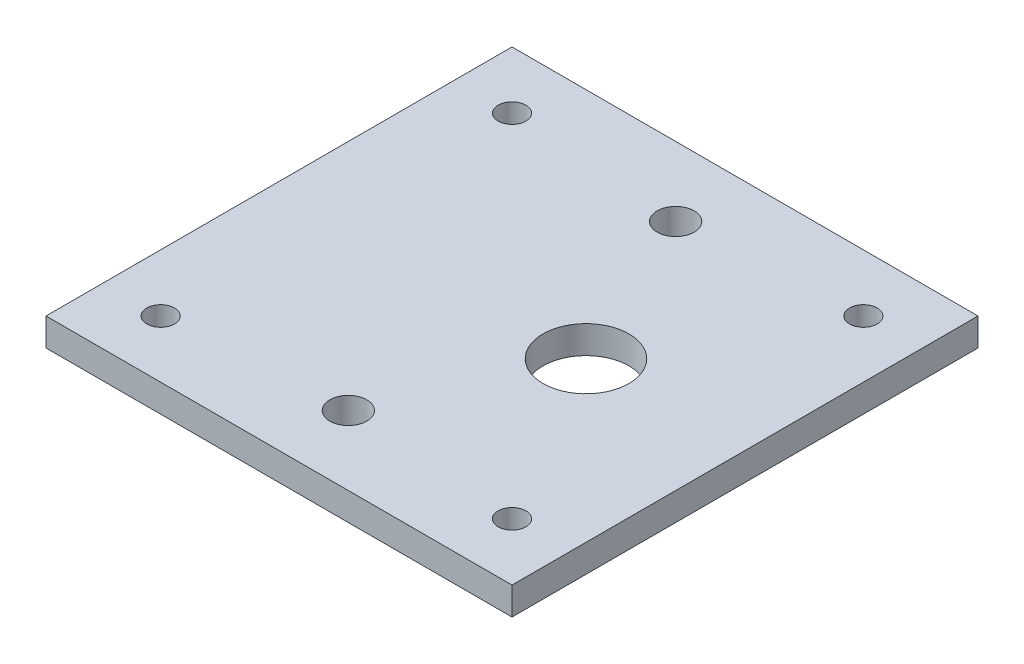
ISO-10303-21;
HEADER;
FILE_DESCRIPTION(('STEP AP214'),'2;1');
FILE_NAME('part.step','',(''),(''),'','','');
FILE_SCHEMA(('AUTOMOTIVE_DESIGN { 1 0 10303 214 1 1 1 1 }'));
ENDSEC;
DATA;
#1=APPLICATION_CONTEXT('core data for automotive mechanical design processes');
#2=APPLICATION_PROTOCOL_DEFINITION('international standard','automotive_design',2000,#1);
#3=PRODUCT_CONTEXT('',#1,'mechanical');
#4=PRODUCT('Part','Part','',(#3));
#5=PRODUCT_RELATED_PRODUCT_CATEGORY('part','',(#4));
#6=PRODUCT_DEFINITION_FORMATION('','',#4);
#7=PRODUCT_DEFINITION_CONTEXT('part definition',#1,'design');
#8=PRODUCT_DEFINITION('design','',#6,#7);
#9=PRODUCT_DEFINITION_SHAPE('','',#8);
#10=(LENGTH_UNIT() NAMED_UNIT(*) SI_UNIT(.MILLI.,.METRE.));
#11=(NAMED_UNIT(*) PLANE_ANGLE_UNIT() SI_UNIT($,.RADIAN.));
#12=(NAMED_UNIT(*) SI_UNIT($,.STERADIAN.) SOLID_ANGLE_UNIT());
#13=UNCERTAINTY_MEASURE_WITH_UNIT(LENGTH_MEASURE(1.E-05),#10,'distance_accuracy_value','');
#14=(GEOMETRIC_REPRESENTATION_CONTEXT(3) GLOBAL_UNCERTAINTY_ASSIGNED_CONTEXT((#13)) GLOBAL_UNIT_ASSIGNED_CONTEXT((#10,
#11,#12)) REPRESENTATION_CONTEXT('',''));
#15=CARTESIAN_POINT('',(0.,0.,0.));
#16=DIRECTION('',(0.,0.,1.));
#17=DIRECTION('',(1.,0.,0.));
#18=AXIS2_PLACEMENT_3D('',#15,#16,#17);
#19=CARTESIAN_POINT('',(25.2,-3.,-25.2));
#20=DIRECTION('',(1.,0.,0.));
#21=DIRECTION('',(0.,0.,-1.));
#22=AXIS2_PLACEMENT_3D('',#19,#20,#21);
#23=PLANE('',#22);
#24=DIRECTION('',(0.,0.,-1.));
#25=VECTOR('',#24,1.);
#26=CARTESIAN_POINT('',(25.2,0.,-25.2));
#27=LINE('',#26,#25);
#28=CARTESIAN_POINT('',(25.2,0.,25.2));
#29=VERTEX_POINT('',#28);
#30=CARTESIAN_POINT('',(25.2,0.,-25.2));
#31=VERTEX_POINT('',#30);
#32=EDGE_CURVE('E106',#29,#31,#27,.T.);
#33=ORIENTED_EDGE('',*,*,#32,.F.);
#34=DIRECTION('',(0.,1.,0.));
#35=VECTOR('',#34,1.);
#36=CARTESIAN_POINT('',(25.2,-3.,25.2));
#37=LINE('',#36,#35);
#38=CARTESIAN_POINT('',(25.2,-3.,25.2));
#39=VERTEX_POINT('',#38);
#40=EDGE_CURVE('E11',#39,#29,#37,.T.);
#41=ORIENTED_EDGE('',*,*,#40,.F.);
#42=DIRECTION('',(0.,0.,-1.));
#43=VECTOR('',#42,1.);
#44=CARTESIAN_POINT('',(25.2,-3.,-25.2));
#45=LINE('',#44,#43);
#46=CARTESIAN_POINT('',(25.2,-3.,-25.2));
#47=VERTEX_POINT('',#46);
#48=EDGE_CURVE('E99',#39,#47,#45,.T.);
#49=ORIENTED_EDGE('',*,*,#48,.T.);
#50=DIRECTION('',(0.,1.,0.));
#51=VECTOR('',#50,1.);
#52=CARTESIAN_POINT('',(25.2,-3.,-25.2));
#53=LINE('',#52,#51);
#54=EDGE_CURVE('E82',#47,#31,#53,.T.);
#55=ORIENTED_EDGE('',*,*,#54,.T.);
#56=EDGE_LOOP('',(#33,#41,#49,#55));
#57=FACE_BOUND('',#56,.T.);
#58=ADVANCED_FACE('F39',(#57),#23,.T.);
#59=CARTESIAN_POINT('',(-25.2,-3.,25.2));
#60=DIRECTION('',(0.,0.,1.));
#61=DIRECTION('',(1.,0.,0.));
#62=AXIS2_PLACEMENT_3D('',#59,#60,#61);
#63=PLANE('',#62);
#64=DIRECTION('',(1.,0.,0.));
#65=VECTOR('',#64,1.);
#66=CARTESIAN_POINT('',(-25.2,0.,25.2));
#67=LINE('',#66,#65);
#68=CARTESIAN_POINT('',(-25.2,0.,25.2));
#69=VERTEX_POINT('',#68);
#70=EDGE_CURVE('E101',#69,#29,#67,.T.);
#71=ORIENTED_EDGE('',*,*,#70,.F.);
#72=DIRECTION('',(0.,1.,0.));
#73=VECTOR('',#72,1.);
#74=CARTESIAN_POINT('',(-25.2,-3.,25.2));
#75=LINE('',#74,#73);
#76=CARTESIAN_POINT('',(-25.2,-3.,25.2));
#77=VERTEX_POINT('',#76);
#78=EDGE_CURVE('E48',#77,#69,#75,.T.);
#79=ORIENTED_EDGE('',*,*,#78,.F.);
#80=DIRECTION('',(1.,0.,0.));
#81=VECTOR('',#80,1.);
#82=CARTESIAN_POINT('',(-25.2,-3.,25.2));
#83=LINE('',#82,#81);
#84=EDGE_CURVE('E96',#77,#39,#83,.T.);
#85=ORIENTED_EDGE('',*,*,#84,.T.);
#86=ORIENTED_EDGE('',*,*,#40,.T.);
#87=EDGE_LOOP('',(#71,#79,#85,#86));
#88=FACE_BOUND('',#87,.T.);
#89=ADVANCED_FACE('F173',(#88),#63,.T.);
#90=CARTESIAN_POINT('',(-25.2,-3.,-25.2));
#91=DIRECTION('',(-1.,0.,0.));
#92=DIRECTION('',(0.,0.,1.));
#93=AXIS2_PLACEMENT_3D('',#90,#91,#92);
#94=PLANE('',#93);
#95=DIRECTION('',(0.,0.,1.));
#96=VECTOR('',#95,1.);
#97=CARTESIAN_POINT('',(-25.2,0.,-25.2));
#98=LINE('',#97,#96);
#99=CARTESIAN_POINT('',(-25.2,0.,-25.2));
#100=VERTEX_POINT('',#99);
#101=EDGE_CURVE('E90',#100,#69,#98,.T.);
#102=ORIENTED_EDGE('',*,*,#101,.F.);
#103=DIRECTION('',(0.,1.,0.));
#104=VECTOR('',#103,1.);
#105=CARTESIAN_POINT('',(-25.2,-3.,-25.2));
#106=LINE('',#105,#104);
#107=CARTESIAN_POINT('',(-25.2,-3.,-25.2));
#108=VERTEX_POINT('',#107);
#109=EDGE_CURVE('E85',#108,#100,#106,.T.);
#110=ORIENTED_EDGE('',*,*,#109,.F.);
#111=DIRECTION('',(0.,0.,1.));
#112=VECTOR('',#111,1.);
#113=CARTESIAN_POINT('',(-25.2,-3.,-25.2));
#114=LINE('',#113,#112);
#115=EDGE_CURVE('E88',#108,#77,#114,.T.);
#116=ORIENTED_EDGE('',*,*,#115,.T.);
#117=ORIENTED_EDGE('',*,*,#78,.T.);
#118=EDGE_LOOP('',(#102,#110,#116,#117));
#119=FACE_BOUND('',#118,.T.);
#120=ADVANCED_FACE('F87',(#119),#94,.T.);
#121=CARTESIAN_POINT('',(-25.2,-3.,-25.2));
#122=DIRECTION('',(0.,0.,-1.));
#123=DIRECTION('',(-1.,0.,0.));
#124=AXIS2_PLACEMENT_3D('',#121,#122,#123);
#125=PLANE('',#124);
#126=DIRECTION('',(-1.,0.,0.));
#127=VECTOR('',#126,1.);
#128=CARTESIAN_POINT('',(-25.2,0.,-25.2));
#129=LINE('',#128,#127);
#130=EDGE_CURVE('E109',#31,#100,#129,.T.);
#131=ORIENTED_EDGE('',*,*,#130,.F.);
#132=ORIENTED_EDGE('',*,*,#54,.F.);
#133=DIRECTION('',(-1.,0.,0.));
#134=VECTOR('',#133,1.);
#135=CARTESIAN_POINT('',(-25.2,-3.,-25.2));
#136=LINE('',#135,#134);
#137=EDGE_CURVE('E95',#47,#108,#136,.T.);
#138=ORIENTED_EDGE('',*,*,#137,.T.);
#139=ORIENTED_EDGE('',*,*,#109,.T.);
#140=EDGE_LOOP('',(#131,#132,#138,#139));
#141=FACE_BOUND('',#140,.T.);
#142=ADVANCED_FACE('F98',(#141),#125,.T.);
#143=CARTESIAN_POINT('',(0.,-3.,0.));
#144=DIRECTION('',(0.,1.,0.));
#145=DIRECTION('',(0.,0.,1.));
#146=AXIS2_PLACEMENT_3D('',#143,#144,#145);
#147=PLANE('',#146);
#148=CARTESIAN_POINT('',(-18.9999999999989,-3.,19.));
#149=DIRECTION('',(0.,1.,0.));
#150=DIRECTION('',(0.,0.,1.));
#151=AXIS2_PLACEMENT_3D('',#148,#149,#150);
#152=CIRCLE('',#151,1.50000000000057);
#153=CARTESIAN_POINT('',(-18.9999999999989,-3.,20.5000000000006));
#154=VERTEX_POINT('',#153);
#155=EDGE_CURVE('E135',#154,#154,#152,.F.);
#156=ORIENTED_EDGE('',*,*,#155,.F.);
#157=EDGE_LOOP('',(#156));
#158=FACE_BOUND('',#157,.T.);
#159=CARTESIAN_POINT('',(19.0000000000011,-3.,18.9999999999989));
#160=DIRECTION('',(0.,1.,0.));
#161=DIRECTION('',(0.,0.,1.));
#162=AXIS2_PLACEMENT_3D('',#159,#160,#161);
#163=CIRCLE('',#162,1.50000000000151);
#164=CARTESIAN_POINT('',(19.0000000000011,-3.,20.5000000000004));
#165=VERTEX_POINT('',#164);
#166=EDGE_CURVE('E142',#165,#165,#163,.F.);
#167=ORIENTED_EDGE('',*,*,#166,.F.);
#168=EDGE_LOOP('',(#167));
#169=FACE_BOUND('',#168,.T.);
#170=CARTESIAN_POINT('',(19.,-3.,-19.0000000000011));
#171=DIRECTION('',(0.,1.,0.));
#172=DIRECTION('',(0.,0.,1.));
#173=AXIS2_PLACEMENT_3D('',#170,#171,#172);
#174=CIRCLE('',#173,1.50000000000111);
#175=CARTESIAN_POINT('',(19.,-3.,-17.5));
#176=VERTEX_POINT('',#175);
#177=EDGE_CURVE('E148',#176,#176,#174,.F.);
#178=ORIENTED_EDGE('',*,*,#177,.F.);
#179=EDGE_LOOP('',(#178));
#180=FACE_BOUND('',#179,.T.);
#181=CARTESIAN_POINT('',(8.,-3.,0.));
#182=DIRECTION('',(0.,1.,0.));
#183=DIRECTION('',(0.,0.,1.));
#184=AXIS2_PLACEMENT_3D('',#181,#182,#183);
#185=CIRCLE('',#184,4.65);
#186=CARTESIAN_POINT('',(8.,-3.,4.65));
#187=VERTEX_POINT('',#186);
#188=EDGE_CURVE('E134',#187,#187,#185,.F.);
#189=ORIENTED_EDGE('',*,*,#188,.F.);
#190=EDGE_LOOP('',(#189));
#191=FACE_BOUND('',#190,.T.);
#192=CARTESIAN_POINT('',(-19.,-3.,-19.));
#193=DIRECTION('',(0.,1.,0.));
#194=DIRECTION('',(0.,0.,1.));
#195=AXIS2_PLACEMENT_3D('',#192,#193,#194);
#196=CIRCLE('',#195,1.5);
#197=CARTESIAN_POINT('',(-19.,-3.,-17.5));
#198=VERTEX_POINT('',#197);
#199=EDGE_CURVE('E127',#198,#198,#196,.F.);
#200=ORIENTED_EDGE('',*,*,#199,.F.);
#201=EDGE_LOOP('',(#200));
#202=FACE_BOUND('',#201,.T.);
#203=CARTESIAN_POINT('',(0.,-3.,-17.7));
#204=DIRECTION('',(0.,1.,0.));
#205=DIRECTION('',(0.,0.,1.));
#206=AXIS2_PLACEMENT_3D('',#203,#204,#205);
#207=CIRCLE('',#206,2.);
#208=CARTESIAN_POINT('',(0.,-3.,-15.7));
#209=VERTEX_POINT('',#208);
#210=EDGE_CURVE('E117',#209,#209,#207,.T.);
#211=ORIENTED_EDGE('',*,*,#210,.T.);
#212=EDGE_LOOP('',(#211));
#213=FACE_BOUND('',#212,.T.);
#214=CARTESIAN_POINT('',(0.,-3.,17.7));
#215=DIRECTION('',(0.,1.,0.));
#216=DIRECTION('',(0.,0.,-1.));
#217=AXIS2_PLACEMENT_3D('',#214,#215,#216);
#218=CIRCLE('',#217,2.);
#219=CARTESIAN_POINT('',(0.,-3.,15.7));
#220=VERTEX_POINT('',#219);
#221=EDGE_CURVE('E122',#220,#220,#218,.T.);
#222=ORIENTED_EDGE('',*,*,#221,.T.);
#223=EDGE_LOOP('',(#222));
#224=FACE_BOUND('',#223,.T.);
#225=ORIENTED_EDGE('',*,*,#48,.F.);
#226=ORIENTED_EDGE('',*,*,#84,.F.);
#227=ORIENTED_EDGE('',*,*,#115,.F.);
#228=ORIENTED_EDGE('',*,*,#137,.F.);
#229=EDGE_LOOP('',(#225,#226,#227,#228));
#230=FACE_BOUND('',#229,.T.);
#231=ADVANCED_FACE('F94',(#158,#169,#180,#191,#202,#213,#224,#230),#147,.F.);
#232=CARTESIAN_POINT('',(0.,0.,0.));
#233=DIRECTION('',(0.,1.,0.));
#234=DIRECTION('',(0.,0.,1.));
#235=AXIS2_PLACEMENT_3D('',#232,#233,#234);
#236=PLANE('',#235);
#237=CARTESIAN_POINT('',(-18.9999999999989,0.,19.));
#238=DIRECTION('',(0.,1.,0.));
#239=DIRECTION('',(0.,0.,1.));
#240=AXIS2_PLACEMENT_3D('',#237,#238,#239);
#241=CIRCLE('',#240,1.50000000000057);
#242=CARTESIAN_POINT('',(-18.9999999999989,0.,20.5000000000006));
#243=VERTEX_POINT('',#242);
#244=EDGE_CURVE('E139',#243,#243,#241,.T.);
#245=ORIENTED_EDGE('',*,*,#244,.F.);
#246=EDGE_LOOP('',(#245));
#247=FACE_BOUND('',#246,.T.);
#248=CARTESIAN_POINT('',(19.0000000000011,0.,18.9999999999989));
#249=DIRECTION('',(0.,1.,0.));
#250=DIRECTION('',(0.,0.,1.));
#251=AXIS2_PLACEMENT_3D('',#248,#249,#250);
#252=CIRCLE('',#251,1.50000000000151);
#253=CARTESIAN_POINT('',(19.0000000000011,0.,20.5000000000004));
#254=VERTEX_POINT('',#253);
#255=EDGE_CURVE('E138',#254,#254,#252,.T.);
#256=ORIENTED_EDGE('',*,*,#255,.F.);
#257=EDGE_LOOP('',(#256));
#258=FACE_BOUND('',#257,.T.);
#259=CARTESIAN_POINT('',(19.,0.,-19.0000000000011));
#260=DIRECTION('',(0.,1.,0.));
#261=DIRECTION('',(0.,0.,1.));
#262=AXIS2_PLACEMENT_3D('',#259,#260,#261);
#263=CIRCLE('',#262,1.50000000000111);
#264=CARTESIAN_POINT('',(19.,0.,-17.5));
#265=VERTEX_POINT('',#264);
#266=EDGE_CURVE('E145',#265,#265,#263,.T.);
#267=ORIENTED_EDGE('',*,*,#266,.F.);
#268=EDGE_LOOP('',(#267));
#269=FACE_BOUND('',#268,.T.);
#270=CARTESIAN_POINT('',(8.,0.,0.));
#271=DIRECTION('',(0.,1.,0.));
#272=DIRECTION('',(0.,0.,1.));
#273=AXIS2_PLACEMENT_3D('',#270,#271,#272);
#274=CIRCLE('',#273,4.65);
#275=CARTESIAN_POINT('',(8.,0.,4.65));
#276=VERTEX_POINT('',#275);
#277=EDGE_CURVE('E151',#276,#276,#274,.T.);
#278=ORIENTED_EDGE('',*,*,#277,.F.);
#279=EDGE_LOOP('',(#278));
#280=FACE_BOUND('',#279,.T.);
#281=CARTESIAN_POINT('',(-19.,0.,-19.));
#282=DIRECTION('',(0.,1.,0.));
#283=DIRECTION('',(0.,0.,1.));
#284=AXIS2_PLACEMENT_3D('',#281,#282,#283);
#285=CIRCLE('',#284,1.5);
#286=CARTESIAN_POINT('',(-19.,0.,-17.5));
#287=VERTEX_POINT('',#286);
#288=EDGE_CURVE('E131',#287,#287,#285,.T.);
#289=ORIENTED_EDGE('',*,*,#288,.F.);
#290=EDGE_LOOP('',(#289));
#291=FACE_BOUND('',#290,.T.);
#292=CARTESIAN_POINT('',(0.,0.,-17.7));
#293=DIRECTION('',(0.,1.,0.));
#294=DIRECTION('',(0.,0.,1.));
#295=AXIS2_PLACEMENT_3D('',#292,#293,#294);
#296=CIRCLE('',#295,2.);
#297=CARTESIAN_POINT('',(0.,0.,-15.7));
#298=VERTEX_POINT('',#297);
#299=EDGE_CURVE('E42',#298,#298,#296,.T.);
#300=ORIENTED_EDGE('',*,*,#299,.F.);
#301=EDGE_LOOP('',(#300));
#302=FACE_BOUND('',#301,.T.);
#303=CARTESIAN_POINT('',(0.,0.,17.7));
#304=DIRECTION('',(0.,1.,0.));
#305=DIRECTION('',(0.,0.,1.));
#306=AXIS2_PLACEMENT_3D('',#303,#304,#305);
#307=CIRCLE('',#306,2.);
#308=CARTESIAN_POINT('',(0.,0.,19.7));
#309=VERTEX_POINT('',#308);
#310=EDGE_CURVE('E115',#309,#309,#307,.T.);
#311=ORIENTED_EDGE('',*,*,#310,.F.);
#312=EDGE_LOOP('',(#311));
#313=FACE_BOUND('',#312,.T.);
#314=ORIENTED_EDGE('',*,*,#32,.T.);
#315=ORIENTED_EDGE('',*,*,#130,.T.);
#316=ORIENTED_EDGE('',*,*,#101,.T.);
#317=ORIENTED_EDGE('',*,*,#70,.T.);
#318=EDGE_LOOP('',(#314,#315,#316,#317));
#319=FACE_BOUND('',#318,.T.);
#320=ADVANCED_FACE('F162',(#247,#258,#269,#280,#291,#302,#313,#319),#236,.T.);
#321=CARTESIAN_POINT('',(0.,-3.,17.7));
#322=DIRECTION('',(0.,1.,0.));
#323=DIRECTION('',(0.,0.,1.));
#324=AXIS2_PLACEMENT_3D('',#321,#322,#323);
#325=CYLINDRICAL_SURFACE('',#324,2.);
#326=ORIENTED_EDGE('',*,*,#310,.T.);
#327=EDGE_LOOP('',(#326));
#328=FACE_BOUND('',#327,.T.);
#329=ORIENTED_EDGE('',*,*,#221,.F.);
#330=EDGE_LOOP('',(#329));
#331=FACE_BOUND('',#330,.T.);
#332=ADVANCED_FACE('F165',(#328,#331),#325,.F.);
#333=CARTESIAN_POINT('',(0.,-3.,-17.7));
#334=DIRECTION('',(0.,1.,0.));
#335=DIRECTION('',(0.,0.,1.));
#336=AXIS2_PLACEMENT_3D('',#333,#334,#335);
#337=CYLINDRICAL_SURFACE('',#336,2.);
#338=ORIENTED_EDGE('',*,*,#299,.T.);
#339=EDGE_LOOP('',(#338));
#340=FACE_BOUND('',#339,.T.);
#341=ORIENTED_EDGE('',*,*,#210,.F.);
#342=EDGE_LOOP('',(#341));
#343=FACE_BOUND('',#342,.T.);
#344=ADVANCED_FACE('F194',(#340,#343),#337,.F.);
#345=CARTESIAN_POINT('',(-19.,-3.001,-19.));
#346=DIRECTION('',(0.,1.,0.));
#347=DIRECTION('',(0.,0.,1.));
#348=AXIS2_PLACEMENT_3D('',#345,#346,#347);
#349=CYLINDRICAL_SURFACE('',#348,1.5);
#350=CARTESIAN_POINT('',(-19.,0.,-17.5));
#351=CARTESIAN_POINT('',(-19.,-0.0312500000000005,-17.5));
#352=CARTESIAN_POINT('',(-19.,-0.0625000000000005,-17.5));
#353=CARTESIAN_POINT('',(-19.,-0.125000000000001,-17.5));
#354=CARTESIAN_POINT('',(-19.,-0.156250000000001,-17.5));
#355=CARTESIAN_POINT('',(-19.,-0.218750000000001,-17.5));
#356=CARTESIAN_POINT('',(-19.,-0.250000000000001,-17.5));
#357=CARTESIAN_POINT('',(-19.,-0.312500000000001,-17.5));
#358=CARTESIAN_POINT('',(-19.,-0.34375,-17.5));
#359=CARTESIAN_POINT('',(-19.,-0.40625,-17.5));
#360=CARTESIAN_POINT('',(-19.,-0.4375,-17.5));
#361=CARTESIAN_POINT('',(-19.,-0.5,-17.5));
#362=CARTESIAN_POINT('',(-19.,-0.53125,-17.5));
#363=CARTESIAN_POINT('',(-19.,-0.593750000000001,-17.5));
#364=CARTESIAN_POINT('',(-19.,-0.625000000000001,-17.5));
#365=CARTESIAN_POINT('',(-19.,-0.687500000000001,-17.5));
#366=CARTESIAN_POINT('',(-19.,-0.71875,-17.5));
#367=CARTESIAN_POINT('',(-19.,-0.78125,-17.5));
#368=CARTESIAN_POINT('',(-19.,-0.8125,-17.5));
#369=CARTESIAN_POINT('',(-19.,-0.875,-17.5));
#370=CARTESIAN_POINT('',(-19.,-0.90625,-17.5));
#371=CARTESIAN_POINT('',(-19.,-0.96875,-17.5));
#372=CARTESIAN_POINT('',(-19.,-1.,-17.5));
#373=CARTESIAN_POINT('',(-19.,-1.0625,-17.5));
#374=CARTESIAN_POINT('',(-19.,-1.09375,-17.5));
#375=CARTESIAN_POINT('',(-19.,-1.15625,-17.5));
#376=CARTESIAN_POINT('',(-19.,-1.1875,-17.5));
#377=CARTESIAN_POINT('',(-19.,-1.25,-17.5));
#378=CARTESIAN_POINT('',(-19.,-1.28125,-17.5));
#379=CARTESIAN_POINT('',(-19.,-1.34375,-17.5));
#380=CARTESIAN_POINT('',(-19.,-1.375,-17.5));
#381=CARTESIAN_POINT('',(-19.,-1.4375,-17.5));
#382=CARTESIAN_POINT('',(-19.,-1.46875,-17.5));
#383=CARTESIAN_POINT('',(-19.,-1.53125,-17.5));
#384=CARTESIAN_POINT('',(-19.,-1.5625,-17.5));
#385=CARTESIAN_POINT('',(-19.,-1.625,-17.5));
#386=CARTESIAN_POINT('',(-19.,-1.65625,-17.5));
#387=CARTESIAN_POINT('',(-19.,-1.71875,-17.5));
#388=CARTESIAN_POINT('',(-19.,-1.75,-17.5));
#389=CARTESIAN_POINT('',(-19.,-1.8125,-17.5));
#390=CARTESIAN_POINT('',(-19.,-1.84375,-17.5));
#391=CARTESIAN_POINT('',(-19.,-1.90625,-17.5));
#392=CARTESIAN_POINT('',(-19.,-1.9375,-17.5));
#393=CARTESIAN_POINT('',(-19.,-2.,-17.5));
#394=CARTESIAN_POINT('',(-19.,-2.03125,-17.5));
#395=CARTESIAN_POINT('',(-19.,-2.09375,-17.5));
#396=CARTESIAN_POINT('',(-19.,-2.125,-17.5));
#397=CARTESIAN_POINT('',(-19.,-2.1875,-17.5));
#398=CARTESIAN_POINT('',(-19.,-2.21875,-17.5));
#399=CARTESIAN_POINT('',(-19.,-2.28125,-17.5));
#400=CARTESIAN_POINT('',(-19.,-2.3125,-17.5));
#401=CARTESIAN_POINT('',(-19.,-2.375,-17.5));
#402=CARTESIAN_POINT('',(-19.,-2.40625,-17.5));
#403=CARTESIAN_POINT('',(-19.,-2.46875,-17.5));
#404=CARTESIAN_POINT('',(-19.,-2.5,-17.5));
#405=CARTESIAN_POINT('',(-19.,-2.5625,-17.5));
#406=CARTESIAN_POINT('',(-19.,-2.59375,-17.5));
#407=CARTESIAN_POINT('',(-19.,-2.65625,-17.5));
#408=CARTESIAN_POINT('',(-19.,-2.6875,-17.5));
#409=CARTESIAN_POINT('',(-19.,-2.75,-17.5));
#410=CARTESIAN_POINT('',(-19.,-2.78125,-17.5));
#411=CARTESIAN_POINT('',(-19.,-2.84375,-17.5));
#412=CARTESIAN_POINT('',(-19.,-2.875,-17.5));
#413=CARTESIAN_POINT('',(-19.,-2.9375,-17.5));
#414=CARTESIAN_POINT('',(-19.,-2.96875,-17.5));
#415=CARTESIAN_POINT('',(-19.,-3.,-17.5));
#416=B_SPLINE_CURVE_WITH_KNOTS('',3,(#350,#351,#352,#353,#354,#355,#356,#357,#358,#359,#360,
#361,#362,#363,#364,#365,#366,#367,#368,#369,#370,#371,#372,#373,#374,#375,#376,#377,#378,#379,
#380,#381,#382,#383,#384,#385,#386,#387,#388,#389,#390,#391,#392,#393,#394,#395,#396,#397,#398,
#399,#400,#401,#402,#403,#404,#405,#406,#407,#408,#409,#410,#411,#412,#413,#414,#415),
.UNSPECIFIED.,.F.,.F.,(4,2,2,2,2,2,2,2,2,2,2,2,2,2,2,2,2,2,2,2,2,2,2,2,2,2,2,2,2,2,2,2,4),(0.,
0.0937500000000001,0.1875,0.28125,0.375,0.46875,0.5625,0.65625,0.75,0.84375,0.9375,1.03125,
1.125,1.21875,1.3125,1.40625,1.5,1.59375,1.6875,1.78125,1.875,1.96875,2.0625,2.15625,2.25,
2.34375,2.4375,2.53125,2.625,2.71875,2.8125,2.90625,3.),.UNSPECIFIED.);
#417=EDGE_CURVE('BSEAM197',#287,#198,#416,.T.);
#418=ORIENTED_EDGE('',*,*,#288,.T.);
#419=ORIENTED_EDGE('',*,*,#199,.T.);
#420=ORIENTED_EDGE('',*,*,#417,.T.);
#421=ORIENTED_EDGE('',*,*,#417,.F.);
#422=EDGE_LOOP('',(#418,#420,#419,#421));
#423=FACE_BOUND('',#422,.T.);
#424=ADVANCED_FACE('F197',(#423),#349,.F.);
#425=CARTESIAN_POINT('',(8.,-3.001,0.));
#426=DIRECTION('',(0.,1.,0.));
#427=DIRECTION('',(0.,0.,1.));
#428=AXIS2_PLACEMENT_3D('',#425,#426,#427);
#429=CYLINDRICAL_SURFACE('',#428,4.65);
#430=CARTESIAN_POINT('',(8.,0.,4.65));
#431=CARTESIAN_POINT('',(8.,-0.0312500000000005,4.65));
#432=CARTESIAN_POINT('',(8.,-0.0625000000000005,4.65));
#433=CARTESIAN_POINT('',(8.,-0.125000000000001,4.65));
#434=CARTESIAN_POINT('',(8.,-0.156250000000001,4.65));
#435=CARTESIAN_POINT('',(8.,-0.218750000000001,4.65));
#436=CARTESIAN_POINT('',(8.,-0.250000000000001,4.65));
#437=CARTESIAN_POINT('',(8.,-0.312500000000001,4.65));
#438=CARTESIAN_POINT('',(8.,-0.34375,4.65));
#439=CARTESIAN_POINT('',(8.,-0.40625,4.65));
#440=CARTESIAN_POINT('',(8.,-0.4375,4.65));
#441=CARTESIAN_POINT('',(8.,-0.5,4.65));
#442=CARTESIAN_POINT('',(8.,-0.53125,4.65));
#443=CARTESIAN_POINT('',(8.,-0.593750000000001,4.65));
#444=CARTESIAN_POINT('',(8.,-0.625000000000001,4.65));
#445=CARTESIAN_POINT('',(8.,-0.687500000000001,4.65));
#446=CARTESIAN_POINT('',(8.,-0.71875,4.65));
#447=CARTESIAN_POINT('',(8.,-0.78125,4.65));
#448=CARTESIAN_POINT('',(8.,-0.8125,4.65));
#449=CARTESIAN_POINT('',(8.,-0.875,4.65));
#450=CARTESIAN_POINT('',(8.,-0.90625,4.65));
#451=CARTESIAN_POINT('',(8.,-0.96875,4.65));
#452=CARTESIAN_POINT('',(8.,-1.,4.65));
#453=CARTESIAN_POINT('',(8.,-1.0625,4.65));
#454=CARTESIAN_POINT('',(8.,-1.09375,4.65));
#455=CARTESIAN_POINT('',(8.,-1.15625,4.65));
#456=CARTESIAN_POINT('',(8.,-1.1875,4.65));
#457=CARTESIAN_POINT('',(8.,-1.25,4.65));
#458=CARTESIAN_POINT('',(8.,-1.28125,4.65));
#459=CARTESIAN_POINT('',(8.,-1.34375,4.65));
#460=CARTESIAN_POINT('',(8.,-1.375,4.65));
#461=CARTESIAN_POINT('',(8.,-1.4375,4.65));
#462=CARTESIAN_POINT('',(8.,-1.46875,4.65));
#463=CARTESIAN_POINT('',(8.,-1.53125,4.65));
#464=CARTESIAN_POINT('',(8.,-1.5625,4.65));
#465=CARTESIAN_POINT('',(8.,-1.625,4.65));
#466=CARTESIAN_POINT('',(8.,-1.65625,4.65));
#467=CARTESIAN_POINT('',(8.,-1.71875,4.65));
#468=CARTESIAN_POINT('',(8.,-1.75,4.65));
#469=CARTESIAN_POINT('',(8.,-1.8125,4.65));
#470=CARTESIAN_POINT('',(8.,-1.84375,4.65));
#471=CARTESIAN_POINT('',(8.,-1.90625,4.65));
#472=CARTESIAN_POINT('',(8.,-1.9375,4.65));
#473=CARTESIAN_POINT('',(8.,-2.,4.65));
#474=CARTESIAN_POINT('',(8.,-2.03125,4.65));
#475=CARTESIAN_POINT('',(8.,-2.09375,4.65));
#476=CARTESIAN_POINT('',(8.,-2.125,4.65));
#477=CARTESIAN_POINT('',(8.,-2.1875,4.65));
#478=CARTESIAN_POINT('',(8.,-2.21875,4.65));
#479=CARTESIAN_POINT('',(8.,-2.28125,4.65));
#480=CARTESIAN_POINT('',(8.,-2.3125,4.65));
#481=CARTESIAN_POINT('',(8.,-2.375,4.65));
#482=CARTESIAN_POINT('',(8.,-2.40625,4.65));
#483=CARTESIAN_POINT('',(8.,-2.46875,4.65));
#484=CARTESIAN_POINT('',(8.,-2.5,4.65));
#485=CARTESIAN_POINT('',(8.,-2.5625,4.65));
#486=CARTESIAN_POINT('',(8.,-2.59375,4.65));
#487=CARTESIAN_POINT('',(8.,-2.65625,4.65));
#488=CARTESIAN_POINT('',(8.,-2.6875,4.65));
#489=CARTESIAN_POINT('',(8.,-2.75,4.65));
#490=CARTESIAN_POINT('',(8.,-2.78125,4.65));
#491=CARTESIAN_POINT('',(8.,-2.84375,4.65));
#492=CARTESIAN_POINT('',(8.,-2.875,4.65));
#493=CARTESIAN_POINT('',(8.,-2.9375,4.65));
#494=CARTESIAN_POINT('',(8.,-2.96875,4.65));
#495=CARTESIAN_POINT('',(8.,-3.,4.65));
#496=B_SPLINE_CURVE_WITH_KNOTS('',3,(#430,#431,#432,#433,#434,#435,#436,#437,#438,#439,#440,
#441,#442,#443,#444,#445,#446,#447,#448,#449,#450,#451,#452,#453,#454,#455,#456,#457,#458,#459,
#460,#461,#462,#463,#464,#465,#466,#467,#468,#469,#470,#471,#472,#473,#474,#475,#476,#477,#478,
#479,#480,#481,#482,#483,#484,#485,#486,#487,#488,#489,#490,#491,#492,#493,#494,#495),
.UNSPECIFIED.,.F.,.F.,(4,2,2,2,2,2,2,2,2,2,2,2,2,2,2,2,2,2,2,2,2,2,2,2,2,2,2,2,2,2,2,2,4),(0.,
0.0937500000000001,0.1875,0.28125,0.375,0.46875,0.5625,0.65625,0.75,0.84375,0.9375,1.03125,
1.125,1.21875,1.3125,1.40625,1.5,1.59375,1.6875,1.78125,1.875,1.96875,2.0625,2.15625,2.25,
2.34375,2.4375,2.53125,2.625,2.71875,2.8125,2.90625,3.),.UNSPECIFIED.);
#497=EDGE_CURVE('BSEAM159',#276,#187,#496,.T.);
#498=ORIENTED_EDGE('',*,*,#277,.T.);
#499=ORIENTED_EDGE('',*,*,#188,.T.);
#500=ORIENTED_EDGE('',*,*,#497,.T.);
#501=ORIENTED_EDGE('',*,*,#497,.F.);
#502=EDGE_LOOP('',(#498,#500,#499,#501));
#503=FACE_BOUND('',#502,.T.);
#504=ADVANCED_FACE('F159',(#503),#429,.F.);
#505=CARTESIAN_POINT('',(19.,-3.001,-19.0000000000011));
#506=DIRECTION('',(0.,1.,0.));
#507=DIRECTION('',(0.,0.,1.));
#508=AXIS2_PLACEMENT_3D('',#505,#506,#507);
#509=CYLINDRICAL_SURFACE('',#508,1.50000000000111);
#510=CARTESIAN_POINT('',(19.,0.,-17.5));
#511=CARTESIAN_POINT('',(19.,-0.0312500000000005,-17.5));
#512=CARTESIAN_POINT('',(19.,-0.0625000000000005,-17.5));
#513=CARTESIAN_POINT('',(19.,-0.125000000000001,-17.5));
#514=CARTESIAN_POINT('',(19.,-0.156250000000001,-17.5));
#515=CARTESIAN_POINT('',(19.,-0.218750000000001,-17.5));
#516=CARTESIAN_POINT('',(19.,-0.250000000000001,-17.5));
#517=CARTESIAN_POINT('',(19.,-0.312500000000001,-17.5));
#518=CARTESIAN_POINT('',(19.,-0.34375,-17.5));
#519=CARTESIAN_POINT('',(19.,-0.40625,-17.5));
#520=CARTESIAN_POINT('',(19.,-0.4375,-17.5));
#521=CARTESIAN_POINT('',(19.,-0.5,-17.5));
#522=CARTESIAN_POINT('',(19.,-0.53125,-17.5));
#523=CARTESIAN_POINT('',(19.,-0.593750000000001,-17.5));
#524=CARTESIAN_POINT('',(19.,-0.625000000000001,-17.5));
#525=CARTESIAN_POINT('',(19.,-0.687500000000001,-17.5));
#526=CARTESIAN_POINT('',(19.,-0.71875,-17.5));
#527=CARTESIAN_POINT('',(19.,-0.78125,-17.5));
#528=CARTESIAN_POINT('',(19.,-0.8125,-17.5));
#529=CARTESIAN_POINT('',(19.,-0.875,-17.5));
#530=CARTESIAN_POINT('',(19.,-0.90625,-17.5));
#531=CARTESIAN_POINT('',(19.,-0.96875,-17.5));
#532=CARTESIAN_POINT('',(19.,-1.,-17.5));
#533=CARTESIAN_POINT('',(19.,-1.0625,-17.5));
#534=CARTESIAN_POINT('',(19.,-1.09375,-17.5));
#535=CARTESIAN_POINT('',(19.,-1.15625,-17.5));
#536=CARTESIAN_POINT('',(19.,-1.1875,-17.5));
#537=CARTESIAN_POINT('',(19.,-1.25,-17.5));
#538=CARTESIAN_POINT('',(19.,-1.28125,-17.5));
#539=CARTESIAN_POINT('',(19.,-1.34375,-17.5));
#540=CARTESIAN_POINT('',(19.,-1.375,-17.5));
#541=CARTESIAN_POINT('',(19.,-1.4375,-17.5));
#542=CARTESIAN_POINT('',(19.,-1.46875,-17.5));
#543=CARTESIAN_POINT('',(19.,-1.53125,-17.5));
#544=CARTESIAN_POINT('',(19.,-1.5625,-17.5));
#545=CARTESIAN_POINT('',(19.,-1.625,-17.5));
#546=CARTESIAN_POINT('',(19.,-1.65625,-17.5));
#547=CARTESIAN_POINT('',(19.,-1.71875,-17.5));
#548=CARTESIAN_POINT('',(19.,-1.75,-17.5));
#549=CARTESIAN_POINT('',(19.,-1.8125,-17.5));
#550=CARTESIAN_POINT('',(19.,-1.84375,-17.5));
#551=CARTESIAN_POINT('',(19.,-1.90625,-17.5));
#552=CARTESIAN_POINT('',(19.,-1.9375,-17.5));
#553=CARTESIAN_POINT('',(19.,-2.,-17.5));
#554=CARTESIAN_POINT('',(19.,-2.03125,-17.5));
#555=CARTESIAN_POINT('',(19.,-2.09375,-17.5));
#556=CARTESIAN_POINT('',(19.,-2.125,-17.5));
#557=CARTESIAN_POINT('',(19.,-2.1875,-17.5));
#558=CARTESIAN_POINT('',(19.,-2.21875,-17.5));
#559=CARTESIAN_POINT('',(19.,-2.28125,-17.5));
#560=CARTESIAN_POINT('',(19.,-2.3125,-17.5));
#561=CARTESIAN_POINT('',(19.,-2.375,-17.5));
#562=CARTESIAN_POINT('',(19.,-2.40625,-17.5));
#563=CARTESIAN_POINT('',(19.,-2.46875,-17.5));
#564=CARTESIAN_POINT('',(19.,-2.5,-17.5));
#565=CARTESIAN_POINT('',(19.,-2.5625,-17.5));
#566=CARTESIAN_POINT('',(19.,-2.59375,-17.5));
#567=CARTESIAN_POINT('',(19.,-2.65625,-17.5));
#568=CARTESIAN_POINT('',(19.,-2.6875,-17.5));
#569=CARTESIAN_POINT('',(19.,-2.75,-17.5));
#570=CARTESIAN_POINT('',(19.,-2.78125,-17.5));
#571=CARTESIAN_POINT('',(19.,-2.84375,-17.5));
#572=CARTESIAN_POINT('',(19.,-2.875,-17.5));
#573=CARTESIAN_POINT('',(19.,-2.9375,-17.5));
#574=CARTESIAN_POINT('',(19.,-2.96875,-17.5));
#575=CARTESIAN_POINT('',(19.,-3.,-17.5));
#576=B_SPLINE_CURVE_WITH_KNOTS('',3,(#510,#511,#512,#513,#514,#515,#516,#517,#518,#519,#520,
#521,#522,#523,#524,#525,#526,#527,#528,#529,#530,#531,#532,#533,#534,#535,#536,#537,#538,#539,
#540,#541,#542,#543,#544,#545,#546,#547,#548,#549,#550,#551,#552,#553,#554,#555,#556,#557,#558,
#559,#560,#561,#562,#563,#564,#565,#566,#567,#568,#569,#570,#571,#572,#573,#574,#575),
.UNSPECIFIED.,.F.,.F.,(4,2,2,2,2,2,2,2,2,2,2,2,2,2,2,2,2,2,2,2,2,2,2,2,2,2,2,2,2,2,2,2,4),(0.,
0.0937500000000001,0.1875,0.28125,0.375,0.46875,0.5625,0.65625,0.75,0.84375,0.9375,1.03125,
1.125,1.21875,1.3125,1.40625,1.5,1.59375,1.6875,1.78125,1.875,1.96875,2.0625,2.15625,2.25,
2.34375,2.4375,2.53125,2.625,2.71875,2.8125,2.90625,3.),.UNSPECIFIED.);
#577=EDGE_CURVE('BSEAM209',#265,#176,#576,.T.);
#578=ORIENTED_EDGE('',*,*,#266,.T.);
#579=ORIENTED_EDGE('',*,*,#177,.T.);
#580=ORIENTED_EDGE('',*,*,#577,.T.);
#581=ORIENTED_EDGE('',*,*,#577,.F.);
#582=EDGE_LOOP('',(#578,#580,#579,#581));
#583=FACE_BOUND('',#582,.T.);
#584=ADVANCED_FACE('F209',(#583),#509,.F.);
#585=CARTESIAN_POINT('',(19.0000000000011,-3.001,18.9999999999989));
#586=DIRECTION('',(0.,1.,0.));
#587=DIRECTION('',(0.,0.,1.));
#588=AXIS2_PLACEMENT_3D('',#585,#586,#587);
#589=CYLINDRICAL_SURFACE('',#588,1.50000000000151);
#590=CARTESIAN_POINT('',(19.0000000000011,0.,20.5000000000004));
#591=CARTESIAN_POINT('',(19.0000000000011,-0.0312500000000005,20.5000000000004));
#592=CARTESIAN_POINT('',(19.0000000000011,-0.0625000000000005,20.5000000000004));
#593=CARTESIAN_POINT('',(19.0000000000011,-0.125000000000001,20.5000000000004));
#594=CARTESIAN_POINT('',(19.0000000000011,-0.156250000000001,20.5000000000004));
#595=CARTESIAN_POINT('',(19.0000000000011,-0.218750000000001,20.5000000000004));
#596=CARTESIAN_POINT('',(19.0000000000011,-0.250000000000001,20.5000000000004));
#597=CARTESIAN_POINT('',(19.0000000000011,-0.312500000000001,20.5000000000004));
#598=CARTESIAN_POINT('',(19.0000000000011,-0.34375,20.5000000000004));
#599=CARTESIAN_POINT('',(19.0000000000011,-0.40625,20.5000000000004));
#600=CARTESIAN_POINT('',(19.0000000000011,-0.4375,20.5000000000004));
#601=CARTESIAN_POINT('',(19.0000000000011,-0.5,20.5000000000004));
#602=CARTESIAN_POINT('',(19.0000000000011,-0.53125,20.5000000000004));
#603=CARTESIAN_POINT('',(19.0000000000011,-0.593750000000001,20.5000000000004));
#604=CARTESIAN_POINT('',(19.0000000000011,-0.625000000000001,20.5000000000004));
#605=CARTESIAN_POINT('',(19.0000000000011,-0.687500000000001,20.5000000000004));
#606=CARTESIAN_POINT('',(19.0000000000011,-0.71875,20.5000000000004));
#607=CARTESIAN_POINT('',(19.0000000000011,-0.78125,20.5000000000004));
#608=CARTESIAN_POINT('',(19.0000000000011,-0.8125,20.5000000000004));
#609=CARTESIAN_POINT('',(19.0000000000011,-0.875,20.5000000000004));
#610=CARTESIAN_POINT('',(19.0000000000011,-0.90625,20.5000000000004));
#611=CARTESIAN_POINT('',(19.0000000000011,-0.96875,20.5000000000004));
#612=CARTESIAN_POINT('',(19.0000000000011,-1.,20.5000000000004));
#613=CARTESIAN_POINT('',(19.0000000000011,-1.0625,20.5000000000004));
#614=CARTESIAN_POINT('',(19.0000000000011,-1.09375,20.5000000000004));
#615=CARTESIAN_POINT('',(19.0000000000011,-1.15625,20.5000000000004));
#616=CARTESIAN_POINT('',(19.0000000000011,-1.1875,20.5000000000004));
#617=CARTESIAN_POINT('',(19.0000000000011,-1.25,20.5000000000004));
#618=CARTESIAN_POINT('',(19.0000000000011,-1.28125,20.5000000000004));
#619=CARTESIAN_POINT('',(19.0000000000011,-1.34375,20.5000000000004));
#620=CARTESIAN_POINT('',(19.0000000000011,-1.375,20.5000000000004));
#621=CARTESIAN_POINT('',(19.0000000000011,-1.4375,20.5000000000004));
#622=CARTESIAN_POINT('',(19.0000000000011,-1.46875,20.5000000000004));
#623=CARTESIAN_POINT('',(19.0000000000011,-1.53125,20.5000000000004));
#624=CARTESIAN_POINT('',(19.0000000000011,-1.5625,20.5000000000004));
#625=CARTESIAN_POINT('',(19.0000000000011,-1.625,20.5000000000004));
#626=CARTESIAN_POINT('',(19.0000000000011,-1.65625,20.5000000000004));
#627=CARTESIAN_POINT('',(19.0000000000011,-1.71875,20.5000000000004));
#628=CARTESIAN_POINT('',(19.0000000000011,-1.75,20.5000000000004));
#629=CARTESIAN_POINT('',(19.0000000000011,-1.8125,20.5000000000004));
#630=CARTESIAN_POINT('',(19.0000000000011,-1.84375,20.5000000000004));
#631=CARTESIAN_POINT('',(19.0000000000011,-1.90625,20.5000000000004));
#632=CARTESIAN_POINT('',(19.0000000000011,-1.9375,20.5000000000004));
#633=CARTESIAN_POINT('',(19.0000000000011,-2.,20.5000000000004));
#634=CARTESIAN_POINT('',(19.0000000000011,-2.03125,20.5000000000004));
#635=CARTESIAN_POINT('',(19.0000000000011,-2.09375,20.5000000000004));
#636=CARTESIAN_POINT('',(19.0000000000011,-2.125,20.5000000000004));
#637=CARTESIAN_POINT('',(19.0000000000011,-2.1875,20.5000000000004));
#638=CARTESIAN_POINT('',(19.0000000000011,-2.21875,20.5000000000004));
#639=CARTESIAN_POINT('',(19.0000000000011,-2.28125,20.5000000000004));
#640=CARTESIAN_POINT('',(19.0000000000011,-2.3125,20.5000000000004));
#641=CARTESIAN_POINT('',(19.0000000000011,-2.375,20.5000000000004));
#642=CARTESIAN_POINT('',(19.0000000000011,-2.40625,20.5000000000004));
#643=CARTESIAN_POINT('',(19.0000000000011,-2.46875,20.5000000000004));
#644=CARTESIAN_POINT('',(19.0000000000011,-2.5,20.5000000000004));
#645=CARTESIAN_POINT('',(19.0000000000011,-2.5625,20.5000000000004));
#646=CARTESIAN_POINT('',(19.0000000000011,-2.59375,20.5000000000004));
#647=CARTESIAN_POINT('',(19.0000000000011,-2.65625,20.5000000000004));
#648=CARTESIAN_POINT('',(19.0000000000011,-2.6875,20.5000000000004));
#649=CARTESIAN_POINT('',(19.0000000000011,-2.75,20.5000000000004));
#650=CARTESIAN_POINT('',(19.0000000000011,-2.78125,20.5000000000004));
#651=CARTESIAN_POINT('',(19.0000000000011,-2.84375,20.5000000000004));
#652=CARTESIAN_POINT('',(19.0000000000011,-2.875,20.5000000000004));
#653=CARTESIAN_POINT('',(19.0000000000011,-2.9375,20.5000000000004));
#654=CARTESIAN_POINT('',(19.0000000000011,-2.96875,20.5000000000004));
#655=CARTESIAN_POINT('',(19.0000000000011,-3.,20.5000000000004));
#656=B_SPLINE_CURVE_WITH_KNOTS('',3,(#590,#591,#592,#593,#594,#595,#596,#597,#598,#599,#600,
#601,#602,#603,#604,#605,#606,#607,#608,#609,#610,#611,#612,#613,#614,#615,#616,#617,#618,#619,
#620,#621,#622,#623,#624,#625,#626,#627,#628,#629,#630,#631,#632,#633,#634,#635,#636,#637,#638,
#639,#640,#641,#642,#643,#644,#645,#646,#647,#648,#649,#650,#651,#652,#653,#654,#655),
.UNSPECIFIED.,.F.,.F.,(4,2,2,2,2,2,2,2,2,2,2,2,2,2,2,2,2,2,2,2,2,2,2,2,2,2,2,2,2,2,2,2,4),(0.,
0.0937500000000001,0.1875,0.28125,0.375,0.46875,0.5625,0.65625,0.75,0.84375,0.9375,1.03125,
1.125,1.21875,1.3125,1.40625,1.5,1.59375,1.6875,1.78125,1.875,1.96875,2.0625,2.15625,2.25,
2.34375,2.4375,2.53125,2.625,2.71875,2.8125,2.90625,3.),.UNSPECIFIED.);
#657=EDGE_CURVE('BSEAM205',#254,#165,#656,.T.);
#658=ORIENTED_EDGE('',*,*,#255,.T.);
#659=ORIENTED_EDGE('',*,*,#166,.T.);
#660=ORIENTED_EDGE('',*,*,#657,.T.);
#661=ORIENTED_EDGE('',*,*,#657,.F.);
#662=EDGE_LOOP('',(#658,#660,#659,#661));
#663=FACE_BOUND('',#662,.T.);
#664=ADVANCED_FACE('F205',(#663),#589,.F.);
#665=CARTESIAN_POINT('',(-18.9999999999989,-3.001,19.));
#666=DIRECTION('',(0.,1.,0.));
#667=DIRECTION('',(0.,0.,1.));
#668=AXIS2_PLACEMENT_3D('',#665,#666,#667);
#669=CYLINDRICAL_SURFACE('',#668,1.50000000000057);
#670=CARTESIAN_POINT('',(-18.9999999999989,0.,20.5000000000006));
#671=CARTESIAN_POINT('',(-18.9999999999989,-0.0312500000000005,20.5000000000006));
#672=CARTESIAN_POINT('',(-18.9999999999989,-0.0625000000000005,20.5000000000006));
#673=CARTESIAN_POINT('',(-18.9999999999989,-0.125000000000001,20.5000000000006));
#674=CARTESIAN_POINT('',(-18.9999999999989,-0.156250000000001,20.5000000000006));
#675=CARTESIAN_POINT('',(-18.9999999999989,-0.218750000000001,20.5000000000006));
#676=CARTESIAN_POINT('',(-18.9999999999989,-0.250000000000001,20.5000000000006));
#677=CARTESIAN_POINT('',(-18.9999999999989,-0.312500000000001,20.5000000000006));
#678=CARTESIAN_POINT('',(-18.9999999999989,-0.34375,20.5000000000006));
#679=CARTESIAN_POINT('',(-18.9999999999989,-0.40625,20.5000000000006));
#680=CARTESIAN_POINT('',(-18.9999999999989,-0.4375,20.5000000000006));
#681=CARTESIAN_POINT('',(-18.9999999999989,-0.5,20.5000000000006));
#682=CARTESIAN_POINT('',(-18.9999999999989,-0.53125,20.5000000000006));
#683=CARTESIAN_POINT('',(-18.9999999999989,-0.593750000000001,20.5000000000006));
#684=CARTESIAN_POINT('',(-18.9999999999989,-0.625000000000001,20.5000000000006));
#685=CARTESIAN_POINT('',(-18.9999999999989,-0.687500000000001,20.5000000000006));
#686=CARTESIAN_POINT('',(-18.9999999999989,-0.71875,20.5000000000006));
#687=CARTESIAN_POINT('',(-18.9999999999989,-0.78125,20.5000000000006));
#688=CARTESIAN_POINT('',(-18.9999999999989,-0.8125,20.5000000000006));
#689=CARTESIAN_POINT('',(-18.9999999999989,-0.875,20.5000000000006));
#690=CARTESIAN_POINT('',(-18.9999999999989,-0.90625,20.5000000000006));
#691=CARTESIAN_POINT('',(-18.9999999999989,-0.96875,20.5000000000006));
#692=CARTESIAN_POINT('',(-18.9999999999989,-1.,20.5000000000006));
#693=CARTESIAN_POINT('',(-18.9999999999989,-1.0625,20.5000000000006));
#694=CARTESIAN_POINT('',(-18.9999999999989,-1.09375,20.5000000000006));
#695=CARTESIAN_POINT('',(-18.9999999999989,-1.15625,20.5000000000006));
#696=CARTESIAN_POINT('',(-18.9999999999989,-1.1875,20.5000000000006));
#697=CARTESIAN_POINT('',(-18.9999999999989,-1.25,20.5000000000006));
#698=CARTESIAN_POINT('',(-18.9999999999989,-1.28125,20.5000000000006));
#699=CARTESIAN_POINT('',(-18.9999999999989,-1.34375,20.5000000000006));
#700=CARTESIAN_POINT('',(-18.9999999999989,-1.375,20.5000000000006));
#701=CARTESIAN_POINT('',(-18.9999999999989,-1.4375,20.5000000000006));
#702=CARTESIAN_POINT('',(-18.9999999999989,-1.46875,20.5000000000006));
#703=CARTESIAN_POINT('',(-18.9999999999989,-1.53125,20.5000000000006));
#704=CARTESIAN_POINT('',(-18.9999999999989,-1.5625,20.5000000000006));
#705=CARTESIAN_POINT('',(-18.9999999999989,-1.625,20.5000000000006));
#706=CARTESIAN_POINT('',(-18.9999999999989,-1.65625,20.5000000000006));
#707=CARTESIAN_POINT('',(-18.9999999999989,-1.71875,20.5000000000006));
#708=CARTESIAN_POINT('',(-18.9999999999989,-1.75,20.5000000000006));
#709=CARTESIAN_POINT('',(-18.9999999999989,-1.8125,20.5000000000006));
#710=CARTESIAN_POINT('',(-18.9999999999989,-1.84375,20.5000000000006));
#711=CARTESIAN_POINT('',(-18.9999999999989,-1.90625,20.5000000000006));
#712=CARTESIAN_POINT('',(-18.9999999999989,-1.9375,20.5000000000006));
#713=CARTESIAN_POINT('',(-18.9999999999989,-2.,20.5000000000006));
#714=CARTESIAN_POINT('',(-18.9999999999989,-2.03125,20.5000000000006));
#715=CARTESIAN_POINT('',(-18.9999999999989,-2.09375,20.5000000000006));
#716=CARTESIAN_POINT('',(-18.9999999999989,-2.125,20.5000000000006));
#717=CARTESIAN_POINT('',(-18.9999999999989,-2.1875,20.5000000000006));
#718=CARTESIAN_POINT('',(-18.9999999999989,-2.21875,20.5000000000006));
#719=CARTESIAN_POINT('',(-18.9999999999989,-2.28125,20.5000000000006));
#720=CARTESIAN_POINT('',(-18.9999999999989,-2.3125,20.5000000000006));
#721=CARTESIAN_POINT('',(-18.9999999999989,-2.375,20.5000000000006));
#722=CARTESIAN_POINT('',(-18.9999999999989,-2.40625,20.5000000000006));
#723=CARTESIAN_POINT('',(-18.9999999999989,-2.46875,20.5000000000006));
#724=CARTESIAN_POINT('',(-18.9999999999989,-2.5,20.5000000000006));
#725=CARTESIAN_POINT('',(-18.9999999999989,-2.5625,20.5000000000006));
#726=CARTESIAN_POINT('',(-18.9999999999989,-2.59375,20.5000000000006));
#727=CARTESIAN_POINT('',(-18.9999999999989,-2.65625,20.5000000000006));
#728=CARTESIAN_POINT('',(-18.9999999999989,-2.6875,20.5000000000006));
#729=CARTESIAN_POINT('',(-18.9999999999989,-2.75,20.5000000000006));
#730=CARTESIAN_POINT('',(-18.9999999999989,-2.78125,20.5000000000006));
#731=CARTESIAN_POINT('',(-18.9999999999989,-2.84375,20.5000000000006));
#732=CARTESIAN_POINT('',(-18.9999999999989,-2.875,20.5000000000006));
#733=CARTESIAN_POINT('',(-18.9999999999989,-2.9375,20.5000000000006));
#734=CARTESIAN_POINT('',(-18.9999999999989,-2.96875,20.5000000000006));
#735=CARTESIAN_POINT('',(-18.9999999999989,-3.,20.5000000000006));
#736=B_SPLINE_CURVE_WITH_KNOTS('',3,(#670,#671,#672,#673,#674,#675,#676,#677,#678,#679,#680,
#681,#682,#683,#684,#685,#686,#687,#688,#689,#690,#691,#692,#693,#694,#695,#696,#697,#698,#699,
#700,#701,#702,#703,#704,#705,#706,#707,#708,#709,#710,#711,#712,#713,#714,#715,#716,#717,#718,
#719,#720,#721,#722,#723,#724,#725,#726,#727,#728,#729,#730,#731,#732,#733,#734,#735),
.UNSPECIFIED.,.F.,.F.,(4,2,2,2,2,2,2,2,2,2,2,2,2,2,2,2,2,2,2,2,2,2,2,2,2,2,2,2,2,2,2,2,4),(0.,
0.0937500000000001,0.1875,0.28125,0.375,0.46875,0.5625,0.65625,0.75,0.84375,0.9375,1.03125,
1.125,1.21875,1.3125,1.40625,1.5,1.59375,1.6875,1.78125,1.875,1.96875,2.0625,2.15625,2.25,
2.34375,2.4375,2.53125,2.625,2.71875,2.8125,2.90625,3.),.UNSPECIFIED.);
#737=EDGE_CURVE('BSEAM202',#243,#154,#736,.T.);
#738=ORIENTED_EDGE('',*,*,#244,.T.);
#739=ORIENTED_EDGE('',*,*,#155,.T.);
#740=ORIENTED_EDGE('',*,*,#737,.T.);
#741=ORIENTED_EDGE('',*,*,#737,.F.);
#742=EDGE_LOOP('',(#738,#740,#739,#741));
#743=FACE_BOUND('',#742,.T.);
#744=ADVANCED_FACE('F202',(#743),#669,.F.);
#745=CLOSED_SHELL('',(#58,#89,#120,#142,#231,#320,#332,#344,#424,#504,#584,#664,#744));
#746=MANIFOLD_SOLID_BREP('B2',#745);
#747=ADVANCED_BREP_SHAPE_REPRESENTATION('',(#18,#746),#14);
#748=SHAPE_DEFINITION_REPRESENTATION(#9,#747);
ENDSEC;
END-ISO-10303-21;
